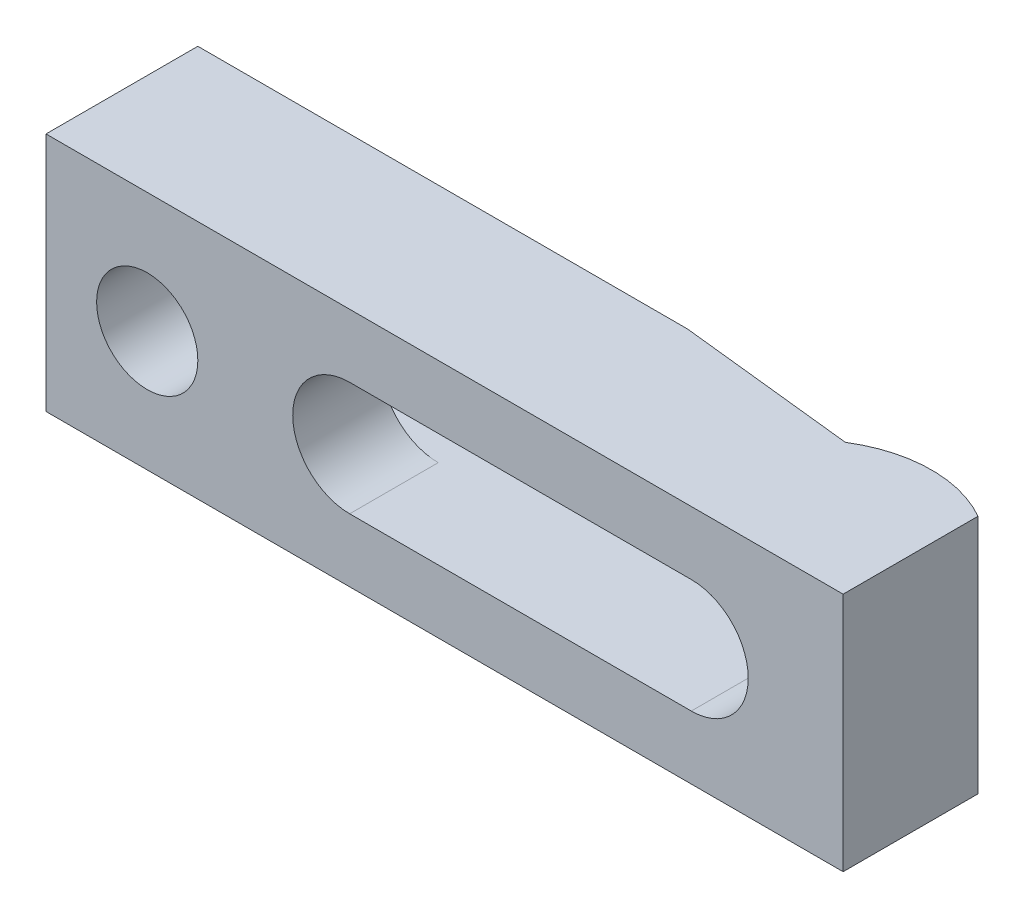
ISO-10303-21;
HEADER;
FILE_DESCRIPTION(('STEP AP214'),'2;1');
FILE_NAME('part.step','',(''),(''),'','','');
FILE_SCHEMA(('AUTOMOTIVE_DESIGN { 1 0 10303 214 1 1 1 1 }'));
ENDSEC;
DATA;
#1=APPLICATION_CONTEXT('core data for automotive mechanical design processes');
#2=APPLICATION_PROTOCOL_DEFINITION('international standard','automotive_design',2000,#1);
#3=PRODUCT_CONTEXT('',#1,'mechanical');
#4=PRODUCT('Part','Part','',(#3));
#5=PRODUCT_RELATED_PRODUCT_CATEGORY('part','',(#4));
#6=PRODUCT_DEFINITION_FORMATION('','',#4);
#7=PRODUCT_DEFINITION_CONTEXT('part definition',#1,'design');
#8=PRODUCT_DEFINITION('design','',#6,#7);
#9=PRODUCT_DEFINITION_SHAPE('','',#8);
#10=(LENGTH_UNIT() NAMED_UNIT(*) SI_UNIT(.MILLI.,.METRE.));
#11=(NAMED_UNIT(*) PLANE_ANGLE_UNIT() SI_UNIT($,.RADIAN.));
#12=(NAMED_UNIT(*) SI_UNIT($,.STERADIAN.) SOLID_ANGLE_UNIT());
#13=UNCERTAINTY_MEASURE_WITH_UNIT(LENGTH_MEASURE(1.E-05),#10,'distance_accuracy_value','');
#14=(GEOMETRIC_REPRESENTATION_CONTEXT(3) GLOBAL_UNCERTAINTY_ASSIGNED_CONTEXT((#13)) GLOBAL_UNIT_ASSIGNED_CONTEXT((#10,
#11,#12)) REPRESENTATION_CONTEXT('',''));
#15=CARTESIAN_POINT('',(0.,0.,0.));
#16=DIRECTION('',(0.,0.,1.));
#17=DIRECTION('',(1.,0.,0.));
#18=AXIS2_PLACEMENT_3D('',#15,#16,#17);
#19=CARTESIAN_POINT('',(-51.,9.5,0.));
#20=DIRECTION('',(0.,0.,-1.));
#21=DIRECTION('',(-1.,0.,0.));
#22=AXIS2_PLACEMENT_3D('',#19,#20,#21);
#23=PLANE('',#22);
#24=DIRECTION('',(1.,0.,0.));
#25=VECTOR('',#24,1.);
#26=CARTESIAN_POINT('',(-27.,4.5,0.));
#27=LINE('',#26,#25);
#28=CARTESIAN_POINT('',(-51.,4.5,0.));
#29=VERTEX_POINT('',#28);
#30=CARTESIAN_POINT('',(-12.3,4.5,0.));
#31=VERTEX_POINT('',#30);
#32=EDGE_CURVE('E127',#29,#31,#27,.T.);
#33=ORIENTED_EDGE('',*,*,#32,.F.);
#34=DIRECTION('',(0.,-1.,0.));
#35=VECTOR('',#34,1.);
#36=CARTESIAN_POINT('',(-51.,9.5,0.));
#37=LINE('',#36,#35);
#38=CARTESIAN_POINT('',(-51.,9.5,0.));
#39=VERTEX_POINT('',#38);
#40=EDGE_CURVE('E144',#39,#29,#37,.T.);
#41=ORIENTED_EDGE('',*,*,#40,.F.);
#42=DIRECTION('',(1.,0.,0.));
#43=VECTOR('',#42,1.);
#44=CARTESIAN_POINT('',(-51.,9.5,0.));
#45=LINE('',#44,#43);
#46=CARTESIAN_POINT('',(-12.3,9.5,0.));
#47=VERTEX_POINT('',#46);
#48=EDGE_CURVE('E262',#39,#47,#45,.T.);
#49=ORIENTED_EDGE('',*,*,#48,.T.);
#50=DIRECTION('',(0.,-1.,0.));
#51=VECTOR('',#50,1.);
#52=CARTESIAN_POINT('',(-12.3,9.5,0.));
#53=LINE('',#52,#51);
#54=EDGE_CURVE('E152',#47,#31,#53,.T.);
#55=ORIENTED_EDGE('',*,*,#54,.T.);
#56=EDGE_LOOP('',(#33,#41,#49,#55));
#57=FACE_BOUND('',#56,.T.);
#58=ADVANCED_FACE('F14',(#57),#23,.T.);
#59=CARTESIAN_POINT('',(-51.,9.5,12.));
#60=DIRECTION('',(-1.,0.,0.));
#61=DIRECTION('',(0.,0.,1.));
#62=AXIS2_PLACEMENT_3D('',#59,#60,#61);
#63=PLANE('',#62);
#64=ORIENTED_EDGE('',*,*,#40,.T.);
#65=DIRECTION('',(0.,0.,1.));
#66=VECTOR('',#65,1.);
#67=CARTESIAN_POINT('',(-51.,4.5,12.));
#68=LINE('',#67,#66);
#69=CARTESIAN_POINT('',(-51.,4.5,5.));
#70=VERTEX_POINT('',#69);
#71=EDGE_CURVE('E138',#29,#70,#68,.T.);
#72=ORIENTED_EDGE('',*,*,#71,.T.);
#73=DIRECTION('',(0.,-1.,0.));
#74=VECTOR('',#73,1.);
#75=CARTESIAN_POINT('',(-51.,9.5,5.));
#76=LINE('',#75,#74);
#77=CARTESIAN_POINT('',(-51.,-4.5,5.));
#78=VERTEX_POINT('',#77);
#79=EDGE_CURVE('E137',#70,#78,#76,.T.);
#80=ORIENTED_EDGE('',*,*,#79,.T.);
#81=DIRECTION('',(0.,0.,1.));
#82=VECTOR('',#81,1.);
#83=CARTESIAN_POINT('',(-51.,-4.5,12.));
#84=LINE('',#83,#82);
#85=CARTESIAN_POINT('',(-51.,-4.5,0.));
#86=VERTEX_POINT('',#85);
#87=EDGE_CURVE('E120',#86,#78,#84,.T.);
#88=ORIENTED_EDGE('',*,*,#87,.F.);
#89=CARTESIAN_POINT('',(-51.,-9.5,0.));
#90=VERTEX_POINT('',#89);
#91=EDGE_CURVE('E134',#86,#90,#37,.T.);
#92=ORIENTED_EDGE('',*,*,#91,.T.);
#93=DIRECTION('',(0.,0.,-1.));
#94=VECTOR('',#93,1.);
#95=CARTESIAN_POINT('',(-51.,-9.5,12.));
#96=LINE('',#95,#94);
#97=CARTESIAN_POINT('',(-51.,-9.5,12.));
#98=VERTEX_POINT('',#97);
#99=EDGE_CURVE('E285',#98,#90,#96,.T.);
#100=ORIENTED_EDGE('',*,*,#99,.F.);
#101=DIRECTION('',(0.,-1.,0.));
#102=VECTOR('',#101,1.);
#103=CARTESIAN_POINT('',(-51.,9.5,12.));
#104=LINE('',#103,#102);
#105=CARTESIAN_POINT('',(-51.,9.5,12.));
#106=VERTEX_POINT('',#105);
#107=EDGE_CURVE('E145',#106,#98,#104,.T.);
#108=ORIENTED_EDGE('',*,*,#107,.F.);
#109=DIRECTION('',(0.,0.,-1.));
#110=VECTOR('',#109,1.);
#111=CARTESIAN_POINT('',(-51.,9.5,12.));
#112=LINE('',#111,#110);
#113=EDGE_CURVE('E258',#106,#39,#112,.T.);
#114=ORIENTED_EDGE('',*,*,#113,.T.);
#115=EDGE_LOOP('',(#64,#72,#80,#88,#92,#100,#108,#114));
#116=FACE_BOUND('',#115,.T.);
#117=ADVANCED_FACE('F132',(#116),#63,.T.);
#118=CARTESIAN_POINT('',(-27.,0.,12.));
#119=DIRECTION('',(0.,0.,-1.));
#120=DIRECTION('',(-1.,0.,0.));
#121=AXIS2_PLACEMENT_3D('',#118,#119,#120);
#122=CYLINDRICAL_SURFACE('',#121,4.5);
#123=DIRECTION('',(0.,0.,-1.));
#124=VECTOR('',#123,1.);
#125=CARTESIAN_POINT('',(-27.,-4.5,12.));
#126=LINE('',#125,#124);
#127=CARTESIAN_POINT('',(-27.,-4.5,12.));
#128=VERTEX_POINT('',#127);
#129=CARTESIAN_POINT('',(-27.,-4.5,5.));
#130=VERTEX_POINT('',#129);
#131=EDGE_CURVE('E176',#128,#130,#126,.T.);
#132=ORIENTED_EDGE('',*,*,#131,.T.);
#133=CARTESIAN_POINT('',(-27.,0.,5.));
#134=DIRECTION('',(0.,0.,-1.));
#135=DIRECTION('',(-1.,0.,0.));
#136=AXIS2_PLACEMENT_3D('',#133,#134,#135);
#137=CIRCLE('',#136,4.5);
#138=CARTESIAN_POINT('',(-27.,4.5,5.));
#139=VERTEX_POINT('',#138);
#140=EDGE_CURVE('E300',#130,#139,#137,.T.);
#141=ORIENTED_EDGE('',*,*,#140,.T.);
#142=DIRECTION('',(0.,0.,-1.));
#143=VECTOR('',#142,1.);
#144=CARTESIAN_POINT('',(-27.,4.5,12.));
#145=LINE('',#144,#143);
#146=CARTESIAN_POINT('',(-27.,4.5,12.));
#147=VERTEX_POINT('',#146);
#148=EDGE_CURVE('E178',#147,#139,#145,.T.);
#149=ORIENTED_EDGE('',*,*,#148,.F.);
#150=CARTESIAN_POINT('',(-27.,0.,12.));
#151=DIRECTION('',(0.,0.,1.));
#152=DIRECTION('',(1.,0.,0.));
#153=AXIS2_PLACEMENT_3D('',#150,#151,#152);
#154=CIRCLE('',#153,4.5);
#155=EDGE_CURVE('E38',#147,#128,#154,.T.);
#156=ORIENTED_EDGE('',*,*,#155,.T.);
#157=EDGE_LOOP('',(#132,#141,#149,#156));
#158=FACE_BOUND('',#157,.T.);
#159=ADVANCED_FACE('F215',(#158),#122,.F.);
#160=CARTESIAN_POINT('',(-43.,0.,12.));
#161=DIRECTION('',(0.,0.,-1.));
#162=DIRECTION('',(-1.,0.,0.));
#163=AXIS2_PLACEMENT_3D('',#160,#161,#162);
#164=CYLINDRICAL_SURFACE('',#163,4.);
#165=CARTESIAN_POINT('',(-43.,0.,12.));
#166=DIRECTION('',(0.,0.,1.));
#167=DIRECTION('',(1.,0.,0.));
#168=AXIS2_PLACEMENT_3D('',#165,#166,#167);
#169=CIRCLE('',#168,4.);
#170=CARTESIAN_POINT('',(-39.,0.,12.));
#171=VERTEX_POINT('',#170);
#172=EDGE_CURVE('E254',#171,#171,#169,.T.);
#173=ORIENTED_EDGE('',*,*,#172,.T.);
#174=EDGE_LOOP('',(#173));
#175=FACE_BOUND('',#174,.T.);
#176=CARTESIAN_POINT('',(-43.,0.,5.));
#177=DIRECTION('',(0.,0.,-1.));
#178=DIRECTION('',(-1.,0.,0.));
#179=AXIS2_PLACEMENT_3D('',#176,#177,#178);
#180=CIRCLE('',#179,4.);
#181=CARTESIAN_POINT('',(-47.,0.,5.));
#182=VERTEX_POINT('',#181);
#183=EDGE_CURVE('E18',#182,#182,#180,.T.);
#184=ORIENTED_EDGE('',*,*,#183,.T.);
#185=EDGE_LOOP('',(#184));
#186=FACE_BOUND('',#185,.T.);
#187=ADVANCED_FACE('F210',(#175,#186),#164,.F.);
#188=CARTESIAN_POINT('',(12.,9.5,12.));
#189=DIRECTION('',(0.,0.,1.));
#190=DIRECTION('',(1.,0.,0.));
#191=AXIS2_PLACEMENT_3D('',#188,#189,#190);
#192=PLANE('',#191);
#193=DIRECTION('',(1.,0.,0.));
#194=VECTOR('',#193,1.);
#195=CARTESIAN_POINT('',(-27.,4.5,12.));
#196=LINE('',#195,#194);
#197=CARTESIAN_POINT('',(0.,4.5,12.));
#198=VERTEX_POINT('',#197);
#199=EDGE_CURVE('E294',#147,#198,#196,.T.);
#200=ORIENTED_EDGE('',*,*,#199,.T.);
#201=CARTESIAN_POINT('',(0.,0.,12.));
#202=DIRECTION('',(0.,0.,1.));
#203=DIRECTION('',(1.,0.,0.));
#204=AXIS2_PLACEMENT_3D('',#201,#202,#203);
#205=CIRCLE('',#204,4.5);
#206=CARTESIAN_POINT('',(0.,-4.5,12.));
#207=VERTEX_POINT('',#206);
#208=EDGE_CURVE('E126',#207,#198,#205,.T.);
#209=ORIENTED_EDGE('',*,*,#208,.F.);
#210=DIRECTION('',(-1.,0.,0.));
#211=VECTOR('',#210,1.);
#212=CARTESIAN_POINT('',(0.,-4.5,12.));
#213=LINE('',#212,#211);
#214=EDGE_CURVE('E174',#207,#128,#213,.T.);
#215=ORIENTED_EDGE('',*,*,#214,.T.);
#216=ORIENTED_EDGE('',*,*,#155,.F.);
#217=EDGE_LOOP('',(#200,#209,#215,#216));
#218=FACE_BOUND('',#217,.T.);
#219=DIRECTION('',(0.,-1.,0.));
#220=VECTOR('',#219,1.);
#221=CARTESIAN_POINT('',(12.,9.5,12.));
#222=LINE('',#221,#220);
#223=CARTESIAN_POINT('',(12.,9.5,12.));
#224=VERTEX_POINT('',#223);
#225=CARTESIAN_POINT('',(12.,-9.5,12.));
#226=VERTEX_POINT('',#225);
#227=EDGE_CURVE('E161',#224,#226,#222,.T.);
#228=ORIENTED_EDGE('',*,*,#227,.F.);
#229=DIRECTION('',(-1.,0.,0.));
#230=VECTOR('',#229,1.);
#231=CARTESIAN_POINT('',(12.,9.5,12.));
#232=LINE('',#231,#230);
#233=EDGE_CURVE('E263',#224,#106,#232,.T.);
#234=ORIENTED_EDGE('',*,*,#233,.T.);
#235=ORIENTED_EDGE('',*,*,#107,.T.);
#236=DIRECTION('',(-1.,0.,0.));
#237=VECTOR('',#236,1.);
#238=CARTESIAN_POINT('',(12.,-9.5,12.));
#239=LINE('',#238,#237);
#240=EDGE_CURVE('E198',#226,#98,#239,.T.);
#241=ORIENTED_EDGE('',*,*,#240,.F.);
#242=EDGE_LOOP('',(#228,#234,#235,#241));
#243=FACE_BOUND('',#242,.T.);
#244=ORIENTED_EDGE('',*,*,#172,.F.);
#245=EDGE_LOOP('',(#244));
#246=FACE_BOUND('',#245,.T.);
#247=ADVANCED_FACE('F228',(#218,#243,#246),#192,.T.);
#248=ORIENTED_EDGE('',*,*,#91,.F.);
#249=DIRECTION('',(-1.,0.,0.));
#250=VECTOR('',#249,1.);
#251=CARTESIAN_POINT('',(0.,-4.5,0.));
#252=LINE('',#251,#250);
#253=CARTESIAN_POINT('',(-12.3,-4.5,0.));
#254=VERTEX_POINT('',#253);
#255=EDGE_CURVE('E115',#254,#86,#252,.T.);
#256=ORIENTED_EDGE('',*,*,#255,.F.);
#257=CARTESIAN_POINT('',(-12.3,-9.5,0.));
#258=VERTEX_POINT('',#257);
#259=EDGE_CURVE('E147',#254,#258,#53,.T.);
#260=ORIENTED_EDGE('',*,*,#259,.T.);
#261=DIRECTION('',(1.,0.,0.));
#262=VECTOR('',#261,1.);
#263=CARTESIAN_POINT('',(-51.,-9.5,0.));
#264=LINE('',#263,#262);
#265=EDGE_CURVE('E143',#90,#258,#264,.T.);
#266=ORIENTED_EDGE('',*,*,#265,.F.);
#267=EDGE_LOOP('',(#248,#256,#260,#266));
#268=FACE_BOUND('',#267,.T.);
#269=ADVANCED_FACE('F141',(#268),#23,.T.);
#270=CARTESIAN_POINT('',(7.,9.5,10.));
#271=DIRECTION('',(0.,-1.,0.));
#272=DIRECTION('',(0.,0.,-1.));
#273=AXIS2_PLACEMENT_3D('',#270,#271,#272);
#274=CYLINDRICAL_SURFACE('',#273,10.);
#275=CARTESIAN_POINT('',(1.23503477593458,4.32720338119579,1.82900397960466));
#276=CARTESIAN_POINT('',(1.3392959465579,4.29746310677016,1.7554155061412));
#277=CARTESIAN_POINT('',(1.4442059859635,4.26342834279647,1.68441413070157));
#278=CARTESIAN_POINT('',(1.65433665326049,4.18636653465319,1.54781239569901));
#279=CARTESIAN_POINT('',(1.75955743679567,4.1433337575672,1.48221551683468));
#280=CARTESIAN_POINT('',(1.96935634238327,4.04783234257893,1.35664268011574));
#281=CARTESIAN_POINT('',(2.0739331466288,3.99534852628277,1.29667600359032));
#282=CARTESIAN_POINT('',(2.28103902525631,3.88083185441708,1.18266652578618));
#283=CARTESIAN_POINT('',(2.38356857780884,3.81880125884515,1.12862232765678));
#284=CARTESIAN_POINT('',(2.58579812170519,3.6848908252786,1.02627575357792));
#285=CARTESIAN_POINT('',(2.68548318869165,3.6129676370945,0.978000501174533));
#286=CARTESIAN_POINT('',(2.88023053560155,3.45971436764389,0.887424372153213));
#287=CARTESIAN_POINT('',(2.97529297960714,3.37838462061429,0.845123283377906));
#288=CARTESIAN_POINT('',(3.15938041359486,3.20688548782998,0.766384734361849));
#289=CARTESIAN_POINT('',(3.24841514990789,3.11673097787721,0.72993767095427));
#290=CARTESIAN_POINT('',(3.41943895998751,2.92807849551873,0.662546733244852));
#291=CARTESIAN_POINT('',(3.50142864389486,2.82958124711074,0.631602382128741));
#292=CARTESIAN_POINT('',(3.65107145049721,2.63318796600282,0.577128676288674));
#293=CARTESIAN_POINT('',(3.71934676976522,2.53587428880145,0.553204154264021));
#294=CARTESIAN_POINT('',(3.84835422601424,2.33546039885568,0.509385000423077));
#295=CARTESIAN_POINT('',(3.90908391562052,2.23235832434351,0.489491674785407));
#296=CARTESIAN_POINT('',(4.02237400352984,2.0211079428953,0.453415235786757));
#297=CARTESIAN_POINT('',(4.07493240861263,1.91295841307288,0.437233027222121));
#298=CARTESIAN_POINT('',(4.17137523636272,1.69237239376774,0.40826295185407));
#299=CARTESIAN_POINT('',(4.21525640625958,1.57993431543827,0.395476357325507));
#300=CARTESIAN_POINT('',(4.29367551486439,1.35231364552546,0.373086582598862));
#301=CARTESIAN_POINT('',(4.32826883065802,1.23715198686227,0.363464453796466));
#302=CARTESIAN_POINT('',(4.38817227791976,1.00419903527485,0.347056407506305));
#303=CARTESIAN_POINT('',(4.41347902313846,0.886406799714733,0.340271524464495));
#304=CARTESIAN_POINT('',(4.45456355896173,0.649112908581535,0.329363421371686));
#305=CARTESIAN_POINT('',(4.47034678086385,0.52961226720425,0.325238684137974));
#306=CARTESIAN_POINT('',(4.49228683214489,0.289654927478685,0.319531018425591));
#307=CARTESIAN_POINT('',(4.49844003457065,0.169197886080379,0.317949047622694));
#308=CARTESIAN_POINT('',(4.50236328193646,-0.195448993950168,0.316922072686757));
#309=CARTESIAN_POINT('',(4.48508888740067,-0.43998604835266,0.321326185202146));
#310=CARTESIAN_POINT('',(4.41115598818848,-0.922668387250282,0.340843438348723));
#311=CARTESIAN_POINT('',(4.35448746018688,-1.16081202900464,0.355959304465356));
#312=CARTESIAN_POINT('',(4.24155182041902,-1.50802975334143,0.38790208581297));
#313=CARTESIAN_POINT('',(4.19918656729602,-1.62222769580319,0.400113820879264));
#314=CARTESIAN_POINT('',(4.105525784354,-1.8464540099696,0.42793535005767));
#315=CARTESIAN_POINT('',(4.05423373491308,-1.95648398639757,0.443543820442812));
#316=CARTESIAN_POINT('',(3.94322634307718,-2.17154608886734,0.478471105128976));
#317=CARTESIAN_POINT('',(3.88351341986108,-2.2765796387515,0.49778885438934));
#318=CARTESIAN_POINT('',(3.7562829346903,-2.48088940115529,0.540465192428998));
#319=CARTESIAN_POINT('',(3.68876843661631,-2.58016785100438,0.563822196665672));
#320=CARTESIAN_POINT('',(3.54751899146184,-2.77110736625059,0.614589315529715));
#321=CARTESIAN_POINT('',(3.47387199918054,-2.8628479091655,0.641945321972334));
#322=CARTESIAN_POINT('',(3.32046671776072,-3.03943651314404,0.701194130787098));
#323=CARTESIAN_POINT('',(3.24071071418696,-3.12428712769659,0.733085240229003));
#324=CARTESIAN_POINT('',(3.07583537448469,-3.2867381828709,0.801689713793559));
#325=CARTESIAN_POINT('',(2.99070922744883,-3.36432909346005,0.838409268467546));
#326=CARTESIAN_POINT('',(2.81616613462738,-3.51173071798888,0.916791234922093));
#327=CARTESIAN_POINT('',(2.72675062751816,-3.58154401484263,0.958451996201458));
#328=CARTESIAN_POINT('',(2.54477615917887,-3.71304338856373,1.04672220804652));
#329=CARTESIAN_POINT('',(2.45222388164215,-3.77474552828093,1.09332153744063));
#330=CARTESIAN_POINT('',(2.26477992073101,-3.89010118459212,1.19154420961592));
#331=CARTESIAN_POINT('',(2.16988785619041,-3.94375337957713,1.24316837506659));
#332=CARTESIAN_POINT('',(1.97882084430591,-4.04299916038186,1.35131354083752));
#333=CARTESIAN_POINT('',(1.88264693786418,-4.08859890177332,1.40783075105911));
#334=CARTESIAN_POINT('',(1.6898720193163,-4.171976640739,1.52560430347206));
#335=CARTESIAN_POINT('',(1.59327121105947,-4.20975803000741,1.58685857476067));
#336=CARTESIAN_POINT('',(1.49687810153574,-4.2437431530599,1.65041022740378));
#337=B_SPLINE_CURVE_WITH_KNOTS('',3,(#275,#276,#277,#278,#279,#280,#281,#282,#283,#284,#285,
#286,#287,#288,#289,#290,#291,#292,#293,#294,#295,#296,#297,#298,#299,#300,#301,#302,#303,#304,
#305,#306,#307,#308,#309,#310,#311,#312,#313,#314,#315,#316,#317,#318,#319,#320,#321,#322,#323,
#324,#325,#326,#327,#328,#329,#330,#331,#332,#333,#334,#335,#336),.UNSPECIFIED.,.F.,.F.,(4,2,2,
2,2,2,2,2,2,2,2,2,2,2,2,2,2,2,2,2,2,2,2,2,2,2,2,2,2,2,4),(0.,0.393065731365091,
0.786382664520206,1.18033699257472,1.57419820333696,1.96984386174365,2.36547546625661,
2.76045128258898,3.1553928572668,3.51873727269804,3.88219923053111,4.24574970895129,
4.60943621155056,4.97090355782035,5.33250257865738,5.69389518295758,6.05542386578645,
6.78729548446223,7.51935338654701,7.88622333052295,8.25295055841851,8.61957264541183,
8.98605123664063,9.34796506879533,9.70974415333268,10.071991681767,10.4341185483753,
10.7955171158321,11.1569749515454,11.518155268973,11.8791785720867),.UNSPECIFIED.);
#338=CARTESIAN_POINT('',(1.7,4.16653333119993,1.52002358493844));
#339=VERTEX_POINT('',#338);
#340=CARTESIAN_POINT('',(1.7,-4.16653333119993,1.52002358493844));
#341=VERTEX_POINT('',#340);
#342=EDGE_CURVE('E170',#339,#341,#337,.T.);
#343=ORIENTED_EDGE('',*,*,#342,.F.);
#344=DIRECTION('',(0.,-1.,0.));
#345=VECTOR('',#344,1.);
#346=CARTESIAN_POINT('',(1.7,9.5,1.52002358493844));
#347=LINE('',#346,#345);
#348=CARTESIAN_POINT('',(1.7,9.5,1.52002358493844));
#349=VERTEX_POINT('',#348);
#350=EDGE_CURVE('E156',#349,#339,#347,.T.);
#351=ORIENTED_EDGE('',*,*,#350,.F.);
#352=CARTESIAN_POINT('',(7.,9.5,10.));
#353=DIRECTION('',(0.,1.,0.));
#354=DIRECTION('',(0.,0.,1.));
#355=AXIS2_PLACEMENT_3D('',#352,#353,#354);
#356=CIRCLE('',#355,10.);
#357=CARTESIAN_POINT('',(12.,9.5,1.33974596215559));
#358=VERTEX_POINT('',#357);
#359=EDGE_CURVE('E270',#358,#349,#356,.T.);
#360=ORIENTED_EDGE('',*,*,#359,.F.);
#361=DIRECTION('',(0.,-1.,0.));
#362=VECTOR('',#361,1.);
#363=CARTESIAN_POINT('',(12.,9.5,1.33974596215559));
#364=LINE('',#363,#362);
#365=CARTESIAN_POINT('',(12.,-9.5,1.33974596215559));
#366=VERTEX_POINT('',#365);
#367=EDGE_CURVE('E159',#358,#366,#364,.T.);
#368=ORIENTED_EDGE('',*,*,#367,.T.);
#369=CARTESIAN_POINT('',(7.,-9.5,10.));
#370=DIRECTION('',(0.,1.,0.));
#371=DIRECTION('',(0.,0.,1.));
#372=AXIS2_PLACEMENT_3D('',#369,#370,#371);
#373=CIRCLE('',#372,10.);
#374=CARTESIAN_POINT('',(1.7,-9.5,1.52002358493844));
#375=VERTEX_POINT('',#374);
#376=EDGE_CURVE('E275',#366,#375,#373,.T.);
#377=ORIENTED_EDGE('',*,*,#376,.T.);
#378=EDGE_CURVE('E155',#341,#375,#347,.T.);
#379=ORIENTED_EDGE('',*,*,#378,.F.);
#380=EDGE_LOOP('',(#343,#351,#360,#368,#377,#379));
#381=FACE_BOUND('',#380,.T.);
#382=ADVANCED_FACE('F201',(#381),#274,.T.);
#383=CARTESIAN_POINT('',(1.7,9.5,1.52002358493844));
#384=DIRECTION('',(-0.107938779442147,0.,0.994157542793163));
#385=DIRECTION('',(0.994157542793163,0.,0.107938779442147));
#386=AXIS2_PLACEMENT_3D('',#383,#384,#385);
#387=PLANE('',#386);
#388=CARTESIAN_POINT('',(0.,0.,1.33544929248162));
#389=DIRECTION('',(-0.107938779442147,0.,0.994157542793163));
#390=DIRECTION('',(-0.994157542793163,0.,-0.107938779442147));
#391=AXIS2_PLACEMENT_3D('',#388,#389,#390);
#392=ELLIPSE('',#391,4.52644556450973,4.5);
#393=CARTESIAN_POINT('',(0.,4.5,1.33544929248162));
#394=VERTEX_POINT('',#393);
#395=EDGE_CURVE('E9',#394,#339,#392,.F.);
#396=ORIENTED_EDGE('',*,*,#395,.F.);
#397=DIRECTION('',(-0.994157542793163,0.,-0.107938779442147));
#398=VECTOR('',#397,1.);
#399=CARTESIAN_POINT('',(1.7,4.5,1.52002358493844));
#400=LINE('',#399,#398);
#401=EDGE_CURVE('E190',#394,#31,#400,.T.);
#402=ORIENTED_EDGE('',*,*,#401,.T.);
#403=ORIENTED_EDGE('',*,*,#54,.F.);
#404=DIRECTION('',(-0.994157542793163,0.,-0.107938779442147));
#405=VECTOR('',#404,1.);
#406=CARTESIAN_POINT('',(1.7,9.5,1.52002358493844));
#407=LINE('',#406,#405);
#408=EDGE_CURVE('E268',#349,#47,#407,.T.);
#409=ORIENTED_EDGE('',*,*,#408,.F.);
#410=ORIENTED_EDGE('',*,*,#350,.T.);
#411=EDGE_LOOP('',(#396,#402,#403,#409,#410));
#412=FACE_BOUND('',#411,.T.);
#413=ADVANCED_FACE('F235',(#412),#387,.F.);
#414=CARTESIAN_POINT('',(0.,-4.5,1.33544929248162));
#415=VERTEX_POINT('',#414);
#416=EDGE_CURVE('E23',#341,#415,#392,.F.);
#417=ORIENTED_EDGE('',*,*,#416,.F.);
#418=ORIENTED_EDGE('',*,*,#378,.T.);
#419=DIRECTION('',(-0.994157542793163,0.,-0.107938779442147));
#420=VECTOR('',#419,1.);
#421=CARTESIAN_POINT('',(1.7,-9.5,1.52002358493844));
#422=LINE('',#421,#420);
#423=EDGE_CURVE('E279',#375,#258,#422,.T.);
#424=ORIENTED_EDGE('',*,*,#423,.T.);
#425=ORIENTED_EDGE('',*,*,#259,.F.);
#426=DIRECTION('',(0.994157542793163,0.,0.107938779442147));
#427=VECTOR('',#426,1.);
#428=CARTESIAN_POINT('',(1.7,-4.5,1.52002358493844));
#429=LINE('',#428,#427);
#430=EDGE_CURVE('E122',#254,#415,#429,.T.);
#431=ORIENTED_EDGE('',*,*,#430,.T.);
#432=EDGE_LOOP('',(#417,#418,#424,#425,#431));
#433=FACE_BOUND('',#432,.T.);
#434=ADVANCED_FACE('F237',(#433),#387,.F.);
#435=CARTESIAN_POINT('',(12.,9.5,12.));
#436=DIRECTION('',(-1.,0.,0.));
#437=DIRECTION('',(0.,0.,1.));
#438=AXIS2_PLACEMENT_3D('',#435,#436,#437);
#439=PLANE('',#438);
#440=ORIENTED_EDGE('',*,*,#367,.F.);
#441=DIRECTION('',(0.,0.,-1.));
#442=VECTOR('',#441,1.);
#443=CARTESIAN_POINT('',(12.,9.5,12.));
#444=LINE('',#443,#442);
#445=EDGE_CURVE('E148',#224,#358,#444,.T.);
#446=ORIENTED_EDGE('',*,*,#445,.F.);
#447=ORIENTED_EDGE('',*,*,#227,.T.);
#448=DIRECTION('',(0.,0.,-1.));
#449=VECTOR('',#448,1.);
#450=CARTESIAN_POINT('',(12.,-9.5,12.));
#451=LINE('',#450,#449);
#452=EDGE_CURVE('E199',#226,#366,#451,.T.);
#453=ORIENTED_EDGE('',*,*,#452,.T.);
#454=EDGE_LOOP('',(#440,#446,#447,#453));
#455=FACE_BOUND('',#454,.T.);
#456=ADVANCED_FACE('F16',(#455),#439,.F.);
#457=CARTESIAN_POINT('',(7.,9.5,10.));
#458=DIRECTION('',(0.,1.,0.));
#459=DIRECTION('',(0.,0.,1.));
#460=AXIS2_PLACEMENT_3D('',#457,#458,#459);
#461=PLANE('',#460);
#462=ORIENTED_EDGE('',*,*,#233,.F.);
#463=ORIENTED_EDGE('',*,*,#445,.T.);
#464=ORIENTED_EDGE('',*,*,#359,.T.);
#465=ORIENTED_EDGE('',*,*,#408,.T.);
#466=ORIENTED_EDGE('',*,*,#48,.F.);
#467=ORIENTED_EDGE('',*,*,#113,.F.);
#468=EDGE_LOOP('',(#462,#463,#464,#465,#466,#467));
#469=FACE_BOUND('',#468,.T.);
#470=ADVANCED_FACE('F223',(#469),#461,.T.);
#471=CARTESIAN_POINT('',(7.,-9.5,10.));
#472=DIRECTION('',(0.,1.,0.));
#473=DIRECTION('',(0.,0.,1.));
#474=AXIS2_PLACEMENT_3D('',#471,#472,#473);
#475=PLANE('',#474);
#476=ORIENTED_EDGE('',*,*,#240,.T.);
#477=ORIENTED_EDGE('',*,*,#99,.T.);
#478=ORIENTED_EDGE('',*,*,#265,.T.);
#479=ORIENTED_EDGE('',*,*,#423,.F.);
#480=ORIENTED_EDGE('',*,*,#376,.F.);
#481=ORIENTED_EDGE('',*,*,#452,.F.);
#482=EDGE_LOOP('',(#476,#477,#478,#479,#480,#481));
#483=FACE_BOUND('',#482,.T.);
#484=ADVANCED_FACE('F209',(#483),#475,.F.);
#485=CARTESIAN_POINT('',(0.,0.,12.));
#486=DIRECTION('',(0.,0.,-1.));
#487=DIRECTION('',(-1.,0.,0.));
#488=AXIS2_PLACEMENT_3D('',#485,#486,#487);
#489=CYLINDRICAL_SURFACE('',#488,4.5);
#490=ORIENTED_EDGE('',*,*,#395,.T.);
#491=ORIENTED_EDGE('',*,*,#342,.T.);
#492=ORIENTED_EDGE('',*,*,#416,.T.);
#493=DIRECTION('',(0.,0.,-1.));
#494=VECTOR('',#493,1.);
#495=CARTESIAN_POINT('',(0.,-4.5,12.));
#496=LINE('',#495,#494);
#497=EDGE_CURVE('E167',#207,#415,#496,.T.);
#498=ORIENTED_EDGE('',*,*,#497,.F.);
#499=ORIENTED_EDGE('',*,*,#208,.T.);
#500=DIRECTION('',(0.,0.,-1.));
#501=VECTOR('',#500,1.);
#502=CARTESIAN_POINT('',(0.,4.5,12.));
#503=LINE('',#502,#501);
#504=EDGE_CURVE('E186',#198,#394,#503,.T.);
#505=ORIENTED_EDGE('',*,*,#504,.T.);
#506=EDGE_LOOP('',(#490,#491,#492,#498,#499,#505));
#507=FACE_BOUND('',#506,.T.);
#508=ADVANCED_FACE('F165',(#507),#489,.F.);
#509=CARTESIAN_POINT('',(-27.,4.5,12.));
#510=DIRECTION('',(0.,1.,0.));
#511=DIRECTION('',(-1.,0.,0.));
#512=AXIS2_PLACEMENT_3D('',#509,#510,#511);
#513=PLANE('',#512);
#514=ORIENTED_EDGE('',*,*,#32,.T.);
#515=ORIENTED_EDGE('',*,*,#401,.F.);
#516=ORIENTED_EDGE('',*,*,#504,.F.);
#517=ORIENTED_EDGE('',*,*,#199,.F.);
#518=ORIENTED_EDGE('',*,*,#148,.T.);
#519=DIRECTION('',(-1.,0.,0.));
#520=VECTOR('',#519,1.);
#521=CARTESIAN_POINT('',(-8.,4.5,5.));
#522=LINE('',#521,#520);
#523=EDGE_CURVE('E30',#139,#70,#522,.T.);
#524=ORIENTED_EDGE('',*,*,#523,.T.);
#525=ORIENTED_EDGE('',*,*,#71,.F.);
#526=EDGE_LOOP('',(#514,#515,#516,#517,#518,#524,#525));
#527=FACE_BOUND('',#526,.T.);
#528=ADVANCED_FACE('F208',(#527),#513,.F.);
#529=CARTESIAN_POINT('',(0.,-4.5,12.));
#530=DIRECTION('',(0.,-1.,0.));
#531=DIRECTION('',(1.,0.,0.));
#532=AXIS2_PLACEMENT_3D('',#529,#530,#531);
#533=PLANE('',#532);
#534=ORIENTED_EDGE('',*,*,#497,.T.);
#535=ORIENTED_EDGE('',*,*,#430,.F.);
#536=ORIENTED_EDGE('',*,*,#255,.T.);
#537=ORIENTED_EDGE('',*,*,#87,.T.);
#538=DIRECTION('',(-1.,0.,0.));
#539=VECTOR('',#538,1.);
#540=CARTESIAN_POINT('',(-8.,-4.5,5.));
#541=LINE('',#540,#539);
#542=EDGE_CURVE('E302',#130,#78,#541,.T.);
#543=ORIENTED_EDGE('',*,*,#542,.F.);
#544=ORIENTED_EDGE('',*,*,#131,.F.);
#545=ORIENTED_EDGE('',*,*,#214,.F.);
#546=EDGE_LOOP('',(#534,#535,#536,#537,#543,#544,#545));
#547=FACE_BOUND('',#546,.T.);
#548=ADVANCED_FACE('F118',(#547),#533,.F.);
#549=CARTESIAN_POINT('',(-8.,-4.5,5.));
#550=DIRECTION('',(0.,0.,-1.));
#551=DIRECTION('',(-1.,0.,0.));
#552=AXIS2_PLACEMENT_3D('',#549,#550,#551);
#553=PLANE('',#552);
#554=ORIENTED_EDGE('',*,*,#183,.F.);
#555=EDGE_LOOP('',(#554));
#556=FACE_BOUND('',#555,.T.);
#557=ORIENTED_EDGE('',*,*,#523,.F.);
#558=ORIENTED_EDGE('',*,*,#140,.F.);
#559=ORIENTED_EDGE('',*,*,#542,.T.);
#560=ORIENTED_EDGE('',*,*,#79,.F.);
#561=EDGE_LOOP('',(#557,#558,#559,#560));
#562=FACE_BOUND('',#561,.T.);
#563=ADVANCED_FACE('F214',(#556,#562),#553,.T.);
#564=CLOSED_SHELL('',(#58,#117,#159,#187,#247,#269,#382,#413,#434,#456,#470,#484,#508,#528,#548,#563));
#565=MANIFOLD_SOLID_BREP('B1',#564);
#566=ADVANCED_BREP_SHAPE_REPRESENTATION('',(#18,#565),#14);
#567=SHAPE_DEFINITION_REPRESENTATION(#9,#566);
ENDSEC;
END-ISO-10303-21;
